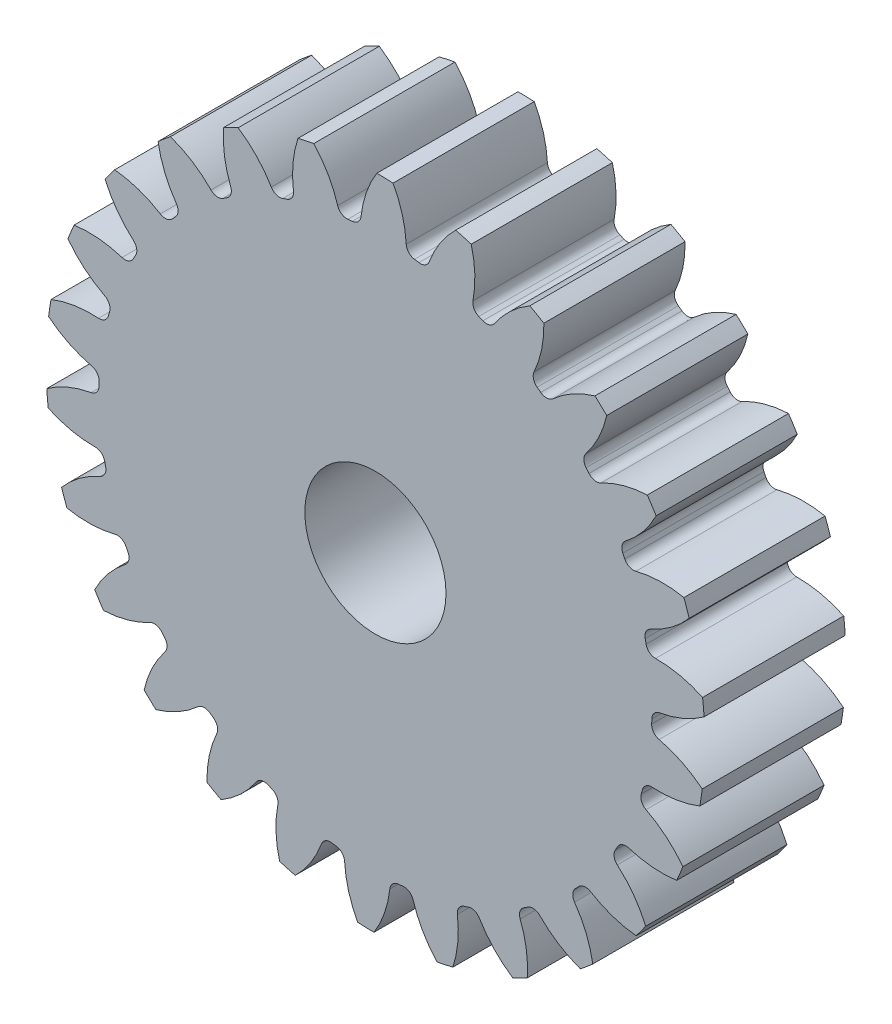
from build123d import *

# Parameters (mm, degrees)
SKETCH3_R         = 237.066666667
GEARBODY_DEPTH    = 101.6
TOOTHCUT_DEPTH    = 351.31952399
CIRPATTERN1_COUNT = 26
BOREDIA_R         = 50.8
BORE_DEPTH        = 12700


with BuildPart() as part:
    # Sketch3 → gearBody (new body)
    with BuildSketch(Plane.XY):
        Circle(SKETCH3_R)
    extrude(amount=GEARBODY_DEPTH)

    # Sketch2 → toothCut (cut, through all)
    with BuildSketch(Plane.XY):
        with BuildLine():
            ThreePointArc((198.830285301, -7.36560192), (198.883442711, -5.754186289), (198.923540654, -4.142392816))
            ThreePointArc((198.923540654, -4.142392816), (200.581143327, 0.199201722), (204.618067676, 2.501446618))
            ThreePointArc((204.618067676, 2.501446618), (221.636226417, 7.555428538), (237.066666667, 16.333923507))
            ThreePointArc((237.066666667, 16.333923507), (237.529309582, -6.8723061), (235.725737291, -30.012968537))
            ThreePointArc((235.725737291, -30.012968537), (220.828650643, -20.357023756), (204.13116304, -14.327565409))
            ThreePointArc((204.13116304, -14.327565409), (200.234099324, -11.795770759), (198.830285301, -7.36560192))
        make_face()
    toothcut = extrude(amount=TOOTHCUT_DEPTH, mode=Mode.SUBTRACT)

    # CirPattern1: toothCut ×26 about axis
    cirpattern1_axis = Axis((0, 0, 0), (0, 0, 1))
    for i in range(1, CIRPATTERN1_COUNT):
        add(toothcut.rotate(cirpattern1_axis, i * 360 / CIRPATTERN1_COUNT), mode=Mode.SUBTRACT)

    # boreDia → bore (cut, symmetric)
    with BuildSketch(Plane.XY):
        Circle(BOREDIA_R)
    extrude(amount=BORE_DEPTH, both=True, mode=Mode.SUBTRACT)


solid = part.part
